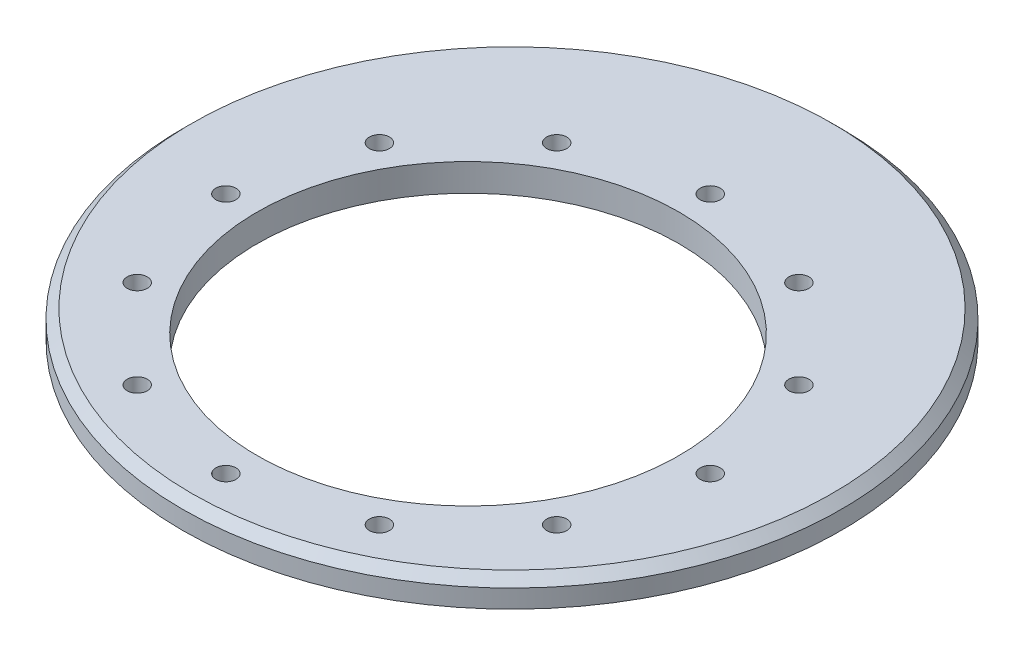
ISO-10303-21;
HEADER;
FILE_DESCRIPTION(('STEP AP214'),'2;1');
FILE_NAME('part.step','',(''),(''),'','','');
FILE_SCHEMA(('AUTOMOTIVE_DESIGN { 1 0 10303 214 1 1 1 1 }'));
ENDSEC;
DATA;
#1=APPLICATION_CONTEXT('core data for automotive mechanical design processes');
#2=APPLICATION_PROTOCOL_DEFINITION('international standard','automotive_design',2000,#1);
#3=PRODUCT_CONTEXT('',#1,'mechanical');
#4=PRODUCT('Part','Part','',(#3));
#5=PRODUCT_RELATED_PRODUCT_CATEGORY('part','',(#4));
#6=PRODUCT_DEFINITION_FORMATION('','',#4);
#7=PRODUCT_DEFINITION_CONTEXT('part definition',#1,'design');
#8=PRODUCT_DEFINITION('design','',#6,#7);
#9=PRODUCT_DEFINITION_SHAPE('','',#8);
#10=(LENGTH_UNIT() NAMED_UNIT(*) SI_UNIT(.MILLI.,.METRE.));
#11=(NAMED_UNIT(*) PLANE_ANGLE_UNIT() SI_UNIT($,.RADIAN.));
#12=(NAMED_UNIT(*) SI_UNIT($,.STERADIAN.) SOLID_ANGLE_UNIT());
#13=UNCERTAINTY_MEASURE_WITH_UNIT(LENGTH_MEASURE(1.E-05),#10,'distance_accuracy_value','');
#14=(GEOMETRIC_REPRESENTATION_CONTEXT(3) GLOBAL_UNCERTAINTY_ASSIGNED_CONTEXT((#13)) GLOBAL_UNIT_ASSIGNED_CONTEXT((#10,
#11,#12)) REPRESENTATION_CONTEXT('',''));
#15=CARTESIAN_POINT('',(0.,0.,0.));
#16=DIRECTION('',(0.,0.,1.));
#17=DIRECTION('',(1.,0.,0.));
#18=AXIS2_PLACEMENT_3D('',#15,#16,#17);
#19=CARTESIAN_POINT('',(0.,-9.525,0.));
#20=DIRECTION('',(0.,1.,0.));
#21=DIRECTION('',(0.,0.,1.));
#22=AXIS2_PLACEMENT_3D('',#19,#20,#21);
#23=CYLINDRICAL_SURFACE('',#22,114.3);
#24=CARTESIAN_POINT('',(0.,-3.17499999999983,0.));
#25=DIRECTION('',(0.,1.,0.));
#26=DIRECTION('',(0.,0.,1.));
#27=AXIS2_PLACEMENT_3D('',#24,#25,#26);
#28=CIRCLE('',#27,114.3);
#29=CARTESIAN_POINT('',(0.,-3.17499999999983,114.3));
#30=VERTEX_POINT('',#29);
#31=EDGE_CURVE('E10',#30,#30,#28,.F.);
#32=CARTESIAN_POINT('',(0.,-9.525,0.));
#33=DIRECTION('',(0.,1.,0.));
#34=DIRECTION('',(0.,0.,1.));
#35=AXIS2_PLACEMENT_3D('',#32,#33,#34);
#36=CIRCLE('',#35,114.3);
#37=CARTESIAN_POINT('',(0.,-9.525,114.3));
#38=VERTEX_POINT('',#37);
#39=EDGE_CURVE('E40',#38,#38,#36,.T.);
#40=CARTESIAN_POINT('',(0.,-3.17499999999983,114.3));
#41=CARTESIAN_POINT('',(0.,-3.24114583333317,114.3));
#42=CARTESIAN_POINT('',(0.,-3.3072916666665,114.3));
#43=CARTESIAN_POINT('',(0.,-3.43958333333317,114.3));
#44=CARTESIAN_POINT('',(0.,-3.50572916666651,114.3));
#45=CARTESIAN_POINT('',(0.,-3.63802083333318,114.3));
#46=CARTESIAN_POINT('',(0.,-3.70416666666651,114.3));
#47=CARTESIAN_POINT('',(0.,-3.83645833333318,114.3));
#48=CARTESIAN_POINT('',(0.,-3.90260416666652,114.3));
#49=CARTESIAN_POINT('',(0.,-4.03489583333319,114.3));
#50=CARTESIAN_POINT('',(0.,-4.10104166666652,114.3));
#51=CARTESIAN_POINT('',(0.,-4.23333333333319,114.3));
#52=CARTESIAN_POINT('',(0.,-4.29947916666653,114.3));
#53=CARTESIAN_POINT('',(0.,-4.4317708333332,114.3));
#54=CARTESIAN_POINT('',(0.,-4.49791666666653,114.3));
#55=CARTESIAN_POINT('',(0.,-4.6302083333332,114.3));
#56=CARTESIAN_POINT('',(0.,-4.69635416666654,114.3));
#57=CARTESIAN_POINT('',(0.,-4.82864583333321,114.3));
#58=CARTESIAN_POINT('',(0.,-4.89479166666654,114.3));
#59=CARTESIAN_POINT('',(0.,-5.02708333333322,114.3));
#60=CARTESIAN_POINT('',(0.,-5.09322916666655,114.3));
#61=CARTESIAN_POINT('',(0.,-5.22552083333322,114.3));
#62=CARTESIAN_POINT('',(0.,-5.29166666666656,114.3));
#63=CARTESIAN_POINT('',(0.,-5.42395833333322,114.3));
#64=CARTESIAN_POINT('',(0.,-5.49010416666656,114.3));
#65=CARTESIAN_POINT('',(0.,-5.62239583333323,114.3));
#66=CARTESIAN_POINT('',(0.,-5.68854166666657,114.3));
#67=CARTESIAN_POINT('',(0.,-5.82083333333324,114.3));
#68=CARTESIAN_POINT('',(0.,-5.88697916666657,114.3));
#69=CARTESIAN_POINT('',(0.,-6.01927083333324,114.3));
#70=CARTESIAN_POINT('',(0.,-6.08541666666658,114.3));
#71=CARTESIAN_POINT('',(0.,-6.21770833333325,114.3));
#72=CARTESIAN_POINT('',(0.,-6.28385416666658,114.3));
#73=CARTESIAN_POINT('',(0.,-6.41614583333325,114.3));
#74=CARTESIAN_POINT('',(0.,-6.48229166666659,114.3));
#75=CARTESIAN_POINT('',(0.,-6.61458333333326,114.3));
#76=CARTESIAN_POINT('',(0.,-6.68072916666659,114.3));
#77=CARTESIAN_POINT('',(0.,-6.81302083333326,114.3));
#78=CARTESIAN_POINT('',(0.,-6.8791666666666,114.3));
#79=CARTESIAN_POINT('',(0.,-7.01145833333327,114.3));
#80=CARTESIAN_POINT('',(0.,-7.0776041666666,114.3));
#81=CARTESIAN_POINT('',(0.,-7.20989583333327,114.3));
#82=CARTESIAN_POINT('',(0.,-7.27604166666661,114.3));
#83=CARTESIAN_POINT('',(0.,-7.40833333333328,114.3));
#84=CARTESIAN_POINT('',(0.,-7.47447916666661,114.3));
#85=CARTESIAN_POINT('',(0.,-7.60677083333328,114.3));
#86=CARTESIAN_POINT('',(0.,-7.67291666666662,114.3));
#87=CARTESIAN_POINT('',(0.,-7.80520833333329,114.3));
#88=CARTESIAN_POINT('',(0.,-7.87135416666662,114.3));
#89=CARTESIAN_POINT('',(0.,-8.00364583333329,114.3));
#90=CARTESIAN_POINT('',(0.,-8.06979166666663,114.3));
#91=CARTESIAN_POINT('',(0.,-8.2020833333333,114.3));
#92=CARTESIAN_POINT('',(0.,-8.26822916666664,114.3));
#93=CARTESIAN_POINT('',(0.,-8.4005208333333,114.3));
#94=CARTESIAN_POINT('',(0.,-8.46666666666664,114.3));
#95=CARTESIAN_POINT('',(0.,-8.59895833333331,114.3));
#96=CARTESIAN_POINT('',(0.,-8.66510416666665,114.3));
#97=CARTESIAN_POINT('',(0.,-8.79739583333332,114.3));
#98=CARTESIAN_POINT('',(0.,-8.86354166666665,114.3));
#99=CARTESIAN_POINT('',(0.,-8.99583333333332,114.3));
#100=CARTESIAN_POINT('',(0.,-9.06197916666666,114.3));
#101=CARTESIAN_POINT('',(0.,-9.19427083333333,114.3));
#102=CARTESIAN_POINT('',(0.,-9.26041666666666,114.3));
#103=CARTESIAN_POINT('',(0.,-9.39270833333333,114.3));
#104=CARTESIAN_POINT('',(0.,-9.45885416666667,114.3));
#105=CARTESIAN_POINT('',(0.,-9.525,114.3));
#106=B_SPLINE_CURVE_WITH_KNOTS('',3,(#40,#41,#42,#43,#44,#45,#46,#47,#48,#49,#50,#51,#52,#53,
#54,#55,#56,#57,#58,#59,#60,#61,#62,#63,#64,#65,#66,#67,#68,#69,#70,#71,#72,#73,#74,#75,#76,#77,
#78,#79,#80,#81,#82,#83,#84,#85,#86,#87,#88,#89,#90,#91,#92,#93,#94,#95,#96,#97,#98,#99,#100,
#101,#102,#103,#104,#105),.UNSPECIFIED.,.F.,.F.,(4,2,2,2,2,2,2,2,2,2,2,2,2,2,2,2,2,2,2,2,2,2,2,
2,2,2,2,2,2,2,2,2,4),(0.,0.198437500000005,0.396875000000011,0.595312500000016,
0.793750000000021,0.992187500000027,1.19062500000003,1.38906250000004,1.58750000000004,
1.78593750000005,1.98437500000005,2.18281250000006,2.38125000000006,2.57968750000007,
2.77812500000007,2.97656250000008,3.17500000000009,3.37343750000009,3.57187500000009,
3.7703125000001,3.96875000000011,4.16718750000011,4.36562500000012,4.56406250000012,
4.76250000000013,4.96093750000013,5.15937500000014,5.35781250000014,5.55625000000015,
5.75468750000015,5.95312500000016,6.15156250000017,6.35000000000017),.UNSPECIFIED.);
#107=EDGE_CURVE('BSEAM29',#30,#38,#106,.T.);
#108=ORIENTED_EDGE('',*,*,#31,.T.);
#109=ORIENTED_EDGE('',*,*,#39,.T.);
#110=ORIENTED_EDGE('',*,*,#107,.T.);
#111=ORIENTED_EDGE('',*,*,#107,.F.);
#112=EDGE_LOOP('',(#108,#110,#109,#111));
#113=FACE_BOUND('',#112,.T.);
#114=ADVANCED_FACE('F29',(#113),#23,.T.);
#115=CARTESIAN_POINT('',(0.,-9.525,0.));
#116=DIRECTION('',(0.,1.,0.));
#117=DIRECTION('',(0.,0.,1.));
#118=AXIS2_PLACEMENT_3D('',#115,#116,#117);
#119=PLANE('',#118);
#120=CARTESIAN_POINT('',(0.,-9.525,15.24));
#121=DIRECTION('',(0.,-1.,0.));
#122=DIRECTION('',(0.,0.,-1.));
#123=AXIS2_PLACEMENT_3D('',#120,#121,#122);
#124=CIRCLE('',#123,73.175);
#125=CARTESIAN_POINT('',(0.,-9.525,-57.935));
#126=VERTEX_POINT('',#125);
#127=EDGE_CURVE('E119',#126,#126,#124,.T.);
#128=ORIENTED_EDGE('',*,*,#127,.F.);
#129=EDGE_LOOP('',(#128));
#130=FACE_BOUND('',#129,.T.);
#131=CARTESIAN_POINT('',(41.9999999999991,-9.525,87.9861339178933));
#132=DIRECTION('',(0.,-1.,0.));
#133=DIRECTION('',(-0.499999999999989,0.,-0.866025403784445));
#134=AXIS2_PLACEMENT_3D('',#131,#132,#133);
#135=CIRCLE('',#134,3.49049999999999);
#136=CARTESIAN_POINT('',(40.2547499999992,-9.525,84.9632722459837));
#137=VERTEX_POINT('',#136);
#138=EDGE_CURVE('E113',#137,#137,#135,.T.);
#139=ORIENTED_EDGE('',*,*,#138,.F.);
#140=EDGE_LOOP('',(#139));
#141=FACE_BOUND('',#140,.T.);
#142=CARTESIAN_POINT('',(72.7461339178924,-9.525,57.2400000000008));
#143=DIRECTION('',(0.,-1.,0.));
#144=DIRECTION('',(-0.866025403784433,0.,-0.50000000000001));
#145=AXIS2_PLACEMENT_3D('',#142,#143,#144);
#146=CIRCLE('',#145,3.49049999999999);
#147=CARTESIAN_POINT('',(69.7232722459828,-9.525,55.4947500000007));
#148=VERTEX_POINT('',#147);
#149=EDGE_CURVE('E107',#148,#148,#146,.T.);
#150=ORIENTED_EDGE('',*,*,#149,.F.);
#151=EDGE_LOOP('',(#150));
#152=FACE_BOUND('',#151,.T.);
#153=CARTESIAN_POINT('',(84.,-9.525,15.2400000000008));
#154=DIRECTION('',(0.,-1.,0.));
#155=DIRECTION('',(-1.,0.,0.));
#156=AXIS2_PLACEMENT_3D('',#153,#154,#155);
#157=CIRCLE('',#156,3.49049999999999);
#158=CARTESIAN_POINT('',(80.5095,-9.525,15.2400000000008));
#159=VERTEX_POINT('',#158);
#160=EDGE_CURVE('E101',#159,#159,#157,.T.);
#161=ORIENTED_EDGE('',*,*,#160,.F.);
#162=EDGE_LOOP('',(#161));
#163=FACE_BOUND('',#162,.T.);
#164=CARTESIAN_POINT('',(72.7461339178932,-9.525,-26.7599999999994));
#165=DIRECTION('',(0.,-1.,0.));
#166=DIRECTION('',(-0.866025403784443,0.,0.499999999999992));
#167=AXIS2_PLACEMENT_3D('',#164,#165,#166);
#168=CIRCLE('',#167,3.49049999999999);
#169=CARTESIAN_POINT('',(69.7232722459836,-9.525,-25.0147499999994));
#170=VERTEX_POINT('',#169);
#171=EDGE_CURVE('E95',#170,#170,#168,.T.);
#172=ORIENTED_EDGE('',*,*,#171,.F.);
#173=EDGE_LOOP('',(#172));
#174=FACE_BOUND('',#173,.T.);
#175=CARTESIAN_POINT('',(42.0000000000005,-9.525,-57.5061339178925));
#176=DIRECTION('',(0.,-1.,0.));
#177=DIRECTION('',(-0.500000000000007,0.,0.866025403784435));
#178=AXIS2_PLACEMENT_3D('',#175,#176,#177);
#179=CIRCLE('',#178,3.49049999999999);
#180=CARTESIAN_POINT('',(40.2547500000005,-9.525,-54.483272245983));
#181=VERTEX_POINT('',#180);
#182=EDGE_CURVE('E89',#181,#181,#179,.T.);
#183=ORIENTED_EDGE('',*,*,#182,.F.);
#184=EDGE_LOOP('',(#183));
#185=FACE_BOUND('',#184,.T.);
#186=CARTESIAN_POINT('',(5.26986032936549E-13,-9.525,-68.76));
#187=DIRECTION('',(0.,-1.,0.));
#188=DIRECTION('',(0.,0.,1.));
#189=AXIS2_PLACEMENT_3D('',#186,#187,#188);
#190=CIRCLE('',#189,3.49049999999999);
#191=CARTESIAN_POINT('',(5.02611987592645E-13,-9.525,-65.2695));
#192=VERTEX_POINT('',#191);
#193=EDGE_CURVE('E83',#192,#192,#190,.T.);
#194=ORIENTED_EDGE('',*,*,#193,.F.);
#195=EDGE_LOOP('',(#194));
#196=FACE_BOUND('',#195,.T.);
#197=CARTESIAN_POINT('',(-41.9999999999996,-9.525,-57.506133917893));
#198=DIRECTION('',(0.,-1.,0.));
#199=DIRECTION('',(0.499999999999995,0.,0.866025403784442));
#200=AXIS2_PLACEMENT_3D('',#197,#198,#199);
#201=CIRCLE('',#200,3.49049999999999);
#202=CARTESIAN_POINT('',(-40.2547499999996,-9.525,-54.4832722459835));
#203=VERTEX_POINT('',#202);
#204=EDGE_CURVE('E77',#203,#203,#201,.T.);
#205=ORIENTED_EDGE('',*,*,#204,.F.);
#206=EDGE_LOOP('',(#205));
#207=FACE_BOUND('',#206,.T.);
#208=CARTESIAN_POINT('',(-72.7461339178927,-9.52500000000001,-26.7600000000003));
#209=DIRECTION('',(0.,-1.,0.));
#210=DIRECTION('',(0.866025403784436,0.,0.500000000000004));
#211=AXIS2_PLACEMENT_3D('',#208,#209,#210);
#212=CIRCLE('',#211,3.49049999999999);
#213=CARTESIAN_POINT('',(-69.7232722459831,-9.52500000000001,-25.0147500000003));
#214=VERTEX_POINT('',#213);
#215=EDGE_CURVE('E71',#214,#214,#212,.T.);
#216=ORIENTED_EDGE('',*,*,#215,.F.);
#217=EDGE_LOOP('',(#216));
#218=FACE_BOUND('',#217,.T.);
#219=CARTESIAN_POINT('',(-84.,-9.52500000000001,15.2399999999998));
#220=DIRECTION('',(0.,-1.,0.));
#221=DIRECTION('',(1.,0.,0.));
#222=AXIS2_PLACEMENT_3D('',#219,#220,#221);
#223=CIRCLE('',#222,3.49049999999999);
#224=CARTESIAN_POINT('',(-80.5095,-9.52500000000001,15.2399999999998));
#225=VERTEX_POINT('',#224);
#226=EDGE_CURVE('E65',#225,#225,#223,.T.);
#227=ORIENTED_EDGE('',*,*,#226,.F.);
#228=EDGE_LOOP('',(#227));
#229=FACE_BOUND('',#228,.T.);
#230=CARTESIAN_POINT('',(-72.7461339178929,-9.52500000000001,57.2399999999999));
#231=DIRECTION('',(0.,-1.,0.));
#232=DIRECTION('',(0.86602540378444,0.,-0.499999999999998));
#233=AXIS2_PLACEMENT_3D('',#230,#231,#232);
#234=CIRCLE('',#233,3.49049999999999);
#235=CARTESIAN_POINT('',(-69.7232722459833,-9.52500000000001,55.4947499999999));
#236=VERTEX_POINT('',#235);
#237=EDGE_CURVE('E59',#236,#236,#234,.T.);
#238=ORIENTED_EDGE('',*,*,#237,.F.);
#239=EDGE_LOOP('',(#238));
#240=FACE_BOUND('',#239,.T.);
#241=CARTESIAN_POINT('',(-42.,-9.525,87.9861339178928));
#242=DIRECTION('',(0.,-1.,0.));
#243=DIRECTION('',(0.500000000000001,0.,-0.866025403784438));
#244=AXIS2_PLACEMENT_3D('',#241,#242,#243);
#245=CIRCLE('',#244,3.49049999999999);
#246=CARTESIAN_POINT('',(-40.25475,-9.525,84.9632722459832));
#247=VERTEX_POINT('',#246);
#248=EDGE_CURVE('E53',#247,#247,#245,.T.);
#249=ORIENTED_EDGE('',*,*,#248,.F.);
#250=EDGE_LOOP('',(#249));
#251=FACE_BOUND('',#250,.T.);
#252=CARTESIAN_POINT('',(0.,-9.525,99.24));
#253=DIRECTION('',(0.,-1.,0.));
#254=DIRECTION('',(0.,0.,-1.));
#255=AXIS2_PLACEMENT_3D('',#252,#253,#254);
#256=CIRCLE('',#255,3.49049999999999);
#257=CARTESIAN_POINT('',(0.,-9.525,95.7495));
#258=VERTEX_POINT('',#257);
#259=EDGE_CURVE('E47',#258,#258,#256,.T.);
#260=ORIENTED_EDGE('',*,*,#259,.F.);
#261=EDGE_LOOP('',(#260));
#262=FACE_BOUND('',#261,.T.);
#263=ORIENTED_EDGE('',*,*,#39,.F.);
#264=EDGE_LOOP('',(#263));
#265=FACE_BOUND('',#264,.T.);
#266=ADVANCED_FACE('F135',(#130,#141,#152,#163,#174,#185,#196,#207,#218,#229,#240,#251,#262,
#265),#119,.F.);
#267=CARTESIAN_POINT('',(0.,0.,0.));
#268=DIRECTION('',(0.,1.,0.));
#269=DIRECTION('',(0.,0.,1.));
#270=AXIS2_PLACEMENT_3D('',#267,#268,#269);
#271=PLANE('',#270);
#272=CARTESIAN_POINT('',(0.,0.,15.24));
#273=DIRECTION('',(0.,-1.,0.));
#274=DIRECTION('',(0.,0.,-1.));
#275=AXIS2_PLACEMENT_3D('',#272,#273,#274);
#276=CIRCLE('',#275,73.175);
#277=CARTESIAN_POINT('',(0.,0.,-57.935));
#278=VERTEX_POINT('',#277);
#279=EDGE_CURVE('E116',#278,#278,#276,.T.);
#280=ORIENTED_EDGE('',*,*,#279,.T.);
#281=EDGE_LOOP('',(#280));
#282=FACE_BOUND('',#281,.T.);
#283=CARTESIAN_POINT('',(41.9999999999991,0.,87.9861339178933));
#284=DIRECTION('',(0.,-1.,0.));
#285=DIRECTION('',(-0.499999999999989,0.,-0.866025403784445));
#286=AXIS2_PLACEMENT_3D('',#283,#284,#285);
#287=CIRCLE('',#286,3.49049999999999);
#288=CARTESIAN_POINT('',(40.2547499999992,0.,84.9632722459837));
#289=VERTEX_POINT('',#288);
#290=EDGE_CURVE('E110',#289,#289,#287,.T.);
#291=ORIENTED_EDGE('',*,*,#290,.T.);
#292=EDGE_LOOP('',(#291));
#293=FACE_BOUND('',#292,.T.);
#294=CARTESIAN_POINT('',(72.7461339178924,0.,57.2400000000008));
#295=DIRECTION('',(0.,-1.,0.));
#296=DIRECTION('',(-0.866025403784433,0.,-0.50000000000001));
#297=AXIS2_PLACEMENT_3D('',#294,#295,#296);
#298=CIRCLE('',#297,3.49049999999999);
#299=CARTESIAN_POINT('',(69.7232722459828,0.,55.4947500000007));
#300=VERTEX_POINT('',#299);
#301=EDGE_CURVE('E104',#300,#300,#298,.T.);
#302=ORIENTED_EDGE('',*,*,#301,.T.);
#303=EDGE_LOOP('',(#302));
#304=FACE_BOUND('',#303,.T.);
#305=CARTESIAN_POINT('',(84.,0.,15.2400000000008));
#306=DIRECTION('',(0.,-1.,0.));
#307=DIRECTION('',(-1.,0.,0.));
#308=AXIS2_PLACEMENT_3D('',#305,#306,#307);
#309=CIRCLE('',#308,3.49049999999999);
#310=CARTESIAN_POINT('',(80.5095,0.,15.2400000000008));
#311=VERTEX_POINT('',#310);
#312=EDGE_CURVE('E98',#311,#311,#309,.T.);
#313=ORIENTED_EDGE('',*,*,#312,.T.);
#314=EDGE_LOOP('',(#313));
#315=FACE_BOUND('',#314,.T.);
#316=CARTESIAN_POINT('',(72.7461339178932,0.,-26.7599999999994));
#317=DIRECTION('',(0.,-1.,0.));
#318=DIRECTION('',(-0.866025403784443,0.,0.499999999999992));
#319=AXIS2_PLACEMENT_3D('',#316,#317,#318);
#320=CIRCLE('',#319,3.49049999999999);
#321=CARTESIAN_POINT('',(69.7232722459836,0.,-25.0147499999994));
#322=VERTEX_POINT('',#321);
#323=EDGE_CURVE('E92',#322,#322,#320,.T.);
#324=ORIENTED_EDGE('',*,*,#323,.T.);
#325=EDGE_LOOP('',(#324));
#326=FACE_BOUND('',#325,.T.);
#327=CARTESIAN_POINT('',(42.0000000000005,0.,-57.5061339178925));
#328=DIRECTION('',(0.,-1.,0.));
#329=DIRECTION('',(-0.500000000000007,0.,0.866025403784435));
#330=AXIS2_PLACEMENT_3D('',#327,#328,#329);
#331=CIRCLE('',#330,3.49049999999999);
#332=CARTESIAN_POINT('',(40.2547500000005,0.,-54.483272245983));
#333=VERTEX_POINT('',#332);
#334=EDGE_CURVE('E86',#333,#333,#331,.T.);
#335=ORIENTED_EDGE('',*,*,#334,.T.);
#336=EDGE_LOOP('',(#335));
#337=FACE_BOUND('',#336,.T.);
#338=CARTESIAN_POINT('',(5.25928545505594E-13,0.,-68.76));
#339=DIRECTION('',(0.,-1.,0.));
#340=DIRECTION('',(0.,0.,1.));
#341=AXIS2_PLACEMENT_3D('',#338,#339,#340);
#342=CIRCLE('',#341,3.49049999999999);
#343=CARTESIAN_POINT('',(5.01554500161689E-13,0.,-65.2695));
#344=VERTEX_POINT('',#343);
#345=EDGE_CURVE('E80',#344,#344,#342,.T.);
#346=ORIENTED_EDGE('',*,*,#345,.T.);
#347=EDGE_LOOP('',(#346));
#348=FACE_BOUND('',#347,.T.);
#349=CARTESIAN_POINT('',(-41.9999999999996,0.,-57.506133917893));
#350=DIRECTION('',(0.,-1.,0.));
#351=DIRECTION('',(0.499999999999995,0.,0.866025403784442));
#352=AXIS2_PLACEMENT_3D('',#349,#350,#351);
#353=CIRCLE('',#352,3.49049999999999);
#354=CARTESIAN_POINT('',(-40.2547499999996,0.,-54.4832722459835));
#355=VERTEX_POINT('',#354);
#356=EDGE_CURVE('E74',#355,#355,#353,.T.);
#357=ORIENTED_EDGE('',*,*,#356,.T.);
#358=EDGE_LOOP('',(#357));
#359=FACE_BOUND('',#358,.T.);
#360=CARTESIAN_POINT('',(-72.7461339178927,0.,-26.7600000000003));
#361=DIRECTION('',(0.,-1.,0.));
#362=DIRECTION('',(0.866025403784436,0.,0.500000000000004));
#363=AXIS2_PLACEMENT_3D('',#360,#361,#362);
#364=CIRCLE('',#363,3.49049999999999);
#365=CARTESIAN_POINT('',(-69.7232722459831,0.,-25.0147500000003));
#366=VERTEX_POINT('',#365);
#367=EDGE_CURVE('E68',#366,#366,#364,.T.);
#368=ORIENTED_EDGE('',*,*,#367,.T.);
#369=EDGE_LOOP('',(#368));
#370=FACE_BOUND('',#369,.T.);
#371=CARTESIAN_POINT('',(-84.,0.,15.2399999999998));
#372=DIRECTION('',(0.,-1.,0.));
#373=DIRECTION('',(1.,0.,0.));
#374=AXIS2_PLACEMENT_3D('',#371,#372,#373);
#375=CIRCLE('',#374,3.49049999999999);
#376=CARTESIAN_POINT('',(-80.5095,0.,15.2399999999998));
#377=VERTEX_POINT('',#376);
#378=EDGE_CURVE('E62',#377,#377,#375,.T.);
#379=ORIENTED_EDGE('',*,*,#378,.T.);
#380=EDGE_LOOP('',(#379));
#381=FACE_BOUND('',#380,.T.);
#382=CARTESIAN_POINT('',(-72.7461339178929,0.,57.2399999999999));
#383=DIRECTION('',(0.,-1.,0.));
#384=DIRECTION('',(0.86602540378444,0.,-0.499999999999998));
#385=AXIS2_PLACEMENT_3D('',#382,#383,#384);
#386=CIRCLE('',#385,3.49049999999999);
#387=CARTESIAN_POINT('',(-69.7232722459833,0.,55.4947499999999));
#388=VERTEX_POINT('',#387);
#389=EDGE_CURVE('E56',#388,#388,#386,.T.);
#390=ORIENTED_EDGE('',*,*,#389,.T.);
#391=EDGE_LOOP('',(#390));
#392=FACE_BOUND('',#391,.T.);
#393=CARTESIAN_POINT('',(-42.,0.,87.9861339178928));
#394=DIRECTION('',(0.,-1.,0.));
#395=DIRECTION('',(0.500000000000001,0.,-0.866025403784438));
#396=AXIS2_PLACEMENT_3D('',#393,#394,#395);
#397=CIRCLE('',#396,3.49049999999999);
#398=CARTESIAN_POINT('',(-40.25475,0.,84.9632722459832));
#399=VERTEX_POINT('',#398);
#400=EDGE_CURVE('E50',#399,#399,#397,.T.);
#401=ORIENTED_EDGE('',*,*,#400,.T.);
#402=EDGE_LOOP('',(#401));
#403=FACE_BOUND('',#402,.T.);
#404=CARTESIAN_POINT('',(0.,0.,99.24));
#405=DIRECTION('',(0.,-1.,0.));
#406=DIRECTION('',(0.,0.,-1.));
#407=AXIS2_PLACEMENT_3D('',#404,#405,#406);
#408=CIRCLE('',#407,3.49049999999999);
#409=CARTESIAN_POINT('',(0.,0.,95.7495));
#410=VERTEX_POINT('',#409);
#411=EDGE_CURVE('E44',#410,#410,#408,.T.);
#412=ORIENTED_EDGE('',*,*,#411,.T.);
#413=EDGE_LOOP('',(#412));
#414=FACE_BOUND('',#413,.T.);
#415=CARTESIAN_POINT('',(0.,0.,0.));
#416=DIRECTION('',(0.,1.,0.));
#417=DIRECTION('',(0.,0.,1.));
#418=AXIS2_PLACEMENT_3D('',#415,#416,#417);
#419=CIRCLE('',#418,111.125);
#420=CARTESIAN_POINT('',(0.,0.,111.125));
#421=VERTEX_POINT('',#420);
#422=EDGE_CURVE('E36',#421,#421,#419,.T.);
#423=ORIENTED_EDGE('',*,*,#422,.T.);
#424=EDGE_LOOP('',(#423));
#425=FACE_BOUND('',#424,.T.);
#426=ADVANCED_FACE('F125',(#282,#293,#304,#315,#326,#337,#348,#359,#370,#381,#392,#403,#414,
#425),#271,.T.);
#427=CARTESIAN_POINT('',(0.,0.,0.));
#428=DIRECTION('',(0.,-1.,0.));
#429=DIRECTION('',(0.,0.,-1.));
#430=AXIS2_PLACEMENT_3D('',#427,#428,#429);
#431=CONICAL_SURFACE('',#430,111.125,0.785398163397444);
#432=ORIENTED_EDGE('',*,*,#31,.F.);
#433=EDGE_LOOP('',(#432));
#434=FACE_BOUND('',#433,.T.);
#435=ORIENTED_EDGE('',*,*,#422,.F.);
#436=EDGE_LOOP('',(#435));
#437=FACE_BOUND('',#436,.T.);
#438=ADVANCED_FACE('F31',(#434,#437),#431,.T.);
#439=CARTESIAN_POINT('',(0.,0.,99.24));
#440=DIRECTION('',(0.,-1.,0.));
#441=DIRECTION('',(0.,0.,-1.));
#442=AXIS2_PLACEMENT_3D('',#439,#440,#441);
#443=CYLINDRICAL_SURFACE('',#442,3.49049999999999);
#444=CARTESIAN_POINT('',(0.,0.,95.7495));
#445=CARTESIAN_POINT('',(0.,-0.0992187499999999,95.7495));
#446=CARTESIAN_POINT('',(0.,-0.1984375,95.7495));
#447=CARTESIAN_POINT('',(0.,-0.396875,95.7495));
#448=CARTESIAN_POINT('',(0.,-0.49609375,95.7495));
#449=CARTESIAN_POINT('',(0.,-0.69453125,95.7495));
#450=CARTESIAN_POINT('',(0.,-0.79375,95.7495));
#451=CARTESIAN_POINT('',(0.,-0.9921875,95.7495));
#452=CARTESIAN_POINT('',(0.,-1.09140625,95.7495));
#453=CARTESIAN_POINT('',(0.,-1.28984375,95.7495));
#454=CARTESIAN_POINT('',(0.,-1.3890625,95.7495));
#455=CARTESIAN_POINT('',(0.,-1.5875,95.7495));
#456=CARTESIAN_POINT('',(0.,-1.68671875,95.7495));
#457=CARTESIAN_POINT('',(0.,-1.88515625,95.7495));
#458=CARTESIAN_POINT('',(0.,-1.984375,95.7495));
#459=CARTESIAN_POINT('',(0.,-2.1828125,95.7495));
#460=CARTESIAN_POINT('',(0.,-2.28203125,95.7495));
#461=CARTESIAN_POINT('',(0.,-2.48046875,95.7495));
#462=CARTESIAN_POINT('',(0.,-2.5796875,95.7495));
#463=CARTESIAN_POINT('',(0.,-2.778125,95.7495));
#464=CARTESIAN_POINT('',(0.,-2.87734375,95.7495));
#465=CARTESIAN_POINT('',(0.,-3.07578125,95.7495));
#466=CARTESIAN_POINT('',(0.,-3.175,95.7495));
#467=CARTESIAN_POINT('',(0.,-3.3734375,95.7495));
#468=CARTESIAN_POINT('',(0.,-3.47265625,95.7495));
#469=CARTESIAN_POINT('',(0.,-3.67109375,95.7495));
#470=CARTESIAN_POINT('',(0.,-3.7703125,95.7495));
#471=CARTESIAN_POINT('',(0.,-3.96875,95.7495));
#472=CARTESIAN_POINT('',(0.,-4.06796875,95.7495));
#473=CARTESIAN_POINT('',(0.,-4.26640625,95.7495));
#474=CARTESIAN_POINT('',(0.,-4.365625,95.7495));
#475=CARTESIAN_POINT('',(0.,-4.5640625,95.7495));
#476=CARTESIAN_POINT('',(0.,-4.66328125,95.7495));
#477=CARTESIAN_POINT('',(0.,-4.86171875,95.7495));
#478=CARTESIAN_POINT('',(0.,-4.9609375,95.7495));
#479=CARTESIAN_POINT('',(0.,-5.159375,95.7495));
#480=CARTESIAN_POINT('',(0.,-5.25859375,95.7495));
#481=CARTESIAN_POINT('',(0.,-5.45703125,95.7495));
#482=CARTESIAN_POINT('',(0.,-5.55625,95.7495));
#483=CARTESIAN_POINT('',(0.,-5.7546875,95.7495));
#484=CARTESIAN_POINT('',(0.,-5.85390625,95.7495));
#485=CARTESIAN_POINT('',(0.,-6.05234375,95.7495));
#486=CARTESIAN_POINT('',(0.,-6.1515625,95.7495));
#487=CARTESIAN_POINT('',(0.,-6.35,95.7495));
#488=CARTESIAN_POINT('',(0.,-6.44921875,95.7495));
#489=CARTESIAN_POINT('',(0.,-6.64765625,95.7495));
#490=CARTESIAN_POINT('',(0.,-6.746875,95.7495));
#491=CARTESIAN_POINT('',(0.,-6.9453125,95.7495));
#492=CARTESIAN_POINT('',(0.,-7.04453125,95.7495));
#493=CARTESIAN_POINT('',(0.,-7.24296875,95.7495));
#494=CARTESIAN_POINT('',(0.,-7.3421875,95.7495));
#495=CARTESIAN_POINT('',(0.,-7.540625,95.7495));
#496=CARTESIAN_POINT('',(0.,-7.63984375,95.7495));
#497=CARTESIAN_POINT('',(0.,-7.83828125,95.7495));
#498=CARTESIAN_POINT('',(0.,-7.9375,95.7495));
#499=CARTESIAN_POINT('',(0.,-8.1359375,95.7495));
#500=CARTESIAN_POINT('',(0.,-8.23515625,95.7495));
#501=CARTESIAN_POINT('',(0.,-8.43359375,95.7495));
#502=CARTESIAN_POINT('',(0.,-8.5328125,95.7495));
#503=CARTESIAN_POINT('',(0.,-8.73125,95.7495));
#504=CARTESIAN_POINT('',(0.,-8.83046875,95.7495));
#505=CARTESIAN_POINT('',(0.,-9.02890625,95.7495));
#506=CARTESIAN_POINT('',(0.,-9.128125,95.7495));
#507=CARTESIAN_POINT('',(0.,-9.3265625,95.7495));
#508=CARTESIAN_POINT('',(0.,-9.42578125,95.7495));
#509=CARTESIAN_POINT('',(0.,-9.525,95.7495));
#510=B_SPLINE_CURVE_WITH_KNOTS('',3,(#444,#445,#446,#447,#448,#449,#450,#451,#452,#453,#454,
#455,#456,#457,#458,#459,#460,#461,#462,#463,#464,#465,#466,#467,#468,#469,#470,#471,#472,#473,
#474,#475,#476,#477,#478,#479,#480,#481,#482,#483,#484,#485,#486,#487,#488,#489,#490,#491,#492,
#493,#494,#495,#496,#497,#498,#499,#500,#501,#502,#503,#504,#505,#506,#507,#508,#509),
.UNSPECIFIED.,.F.,.F.,(4,2,2,2,2,2,2,2,2,2,2,2,2,2,2,2,2,2,2,2,2,2,2,2,2,2,2,2,2,2,2,2,4),(0.,
0.29765625,0.5953125,0.89296875,1.190625,1.48828125,1.7859375,2.08359375,2.38125,2.67890625,
2.9765625,3.27421875,3.571875,3.86953125,4.1671875,4.46484375,4.7625,5.06015625,5.3578125,
5.65546875,5.953125,6.25078125,6.5484375,6.84609375,7.14375,7.44140625,7.7390625,8.03671875,
8.334375,8.63203125,8.9296875,9.22734375,9.525),.UNSPECIFIED.);
#511=EDGE_CURVE('BSEAM171',#410,#258,#510,.T.);
#512=ORIENTED_EDGE('',*,*,#411,.F.);
#513=ORIENTED_EDGE('',*,*,#259,.T.);
#514=ORIENTED_EDGE('',*,*,#511,.T.);
#515=ORIENTED_EDGE('',*,*,#511,.F.);
#516=EDGE_LOOP('',(#512,#514,#513,#515));
#517=FACE_BOUND('',#516,.T.);
#518=ADVANCED_FACE('F171',(#517),#443,.F.);
#519=CARTESIAN_POINT('',(-42.,0.,87.9861339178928));
#520=DIRECTION('',(0.,-1.,0.));
#521=DIRECTION('',(0.,0.,-1.));
#522=AXIS2_PLACEMENT_3D('',#519,#520,#521);
#523=CYLINDRICAL_SURFACE('',#522,3.49049999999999);
#524=ORIENTED_EDGE('',*,*,#400,.F.);
#525=EDGE_LOOP('',(#524));
#526=FACE_BOUND('',#525,.T.);
#527=ORIENTED_EDGE('',*,*,#248,.T.);
#528=EDGE_LOOP('',(#527));
#529=FACE_BOUND('',#528,.T.);
#530=ADVANCED_FACE('F174',(#526,#529),#523,.F.);
#531=CARTESIAN_POINT('',(-72.7461339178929,0.,57.2399999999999));
#532=DIRECTION('',(0.,-1.,0.));
#533=DIRECTION('',(0.,0.,-1.));
#534=AXIS2_PLACEMENT_3D('',#531,#532,#533);
#535=CYLINDRICAL_SURFACE('',#534,3.49049999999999);
#536=ORIENTED_EDGE('',*,*,#389,.F.);
#537=EDGE_LOOP('',(#536));
#538=FACE_BOUND('',#537,.T.);
#539=ORIENTED_EDGE('',*,*,#237,.T.);
#540=EDGE_LOOP('',(#539));
#541=FACE_BOUND('',#540,.T.);
#542=ADVANCED_FACE('F178',(#538,#541),#535,.F.);
#543=CARTESIAN_POINT('',(-84.,0.,15.2399999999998));
#544=DIRECTION('',(0.,-1.,0.));
#545=DIRECTION('',(1.,0.,0.));
#546=AXIS2_PLACEMENT_3D('',#543,#544,#545);
#547=CYLINDRICAL_SURFACE('',#546,3.49049999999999);
#548=ORIENTED_EDGE('',*,*,#378,.F.);
#549=EDGE_LOOP('',(#548));
#550=FACE_BOUND('',#549,.T.);
#551=ORIENTED_EDGE('',*,*,#226,.T.);
#552=EDGE_LOOP('',(#551));
#553=FACE_BOUND('',#552,.T.);
#554=ADVANCED_FACE('F182',(#550,#553),#547,.F.);
#555=CARTESIAN_POINT('',(-72.7461339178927,0.,-26.7600000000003));
#556=DIRECTION('',(0.,-1.,0.));
#557=DIRECTION('',(1.,0.,0.));
#558=AXIS2_PLACEMENT_3D('',#555,#556,#557);
#559=CYLINDRICAL_SURFACE('',#558,3.49049999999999);
#560=ORIENTED_EDGE('',*,*,#367,.F.);
#561=EDGE_LOOP('',(#560));
#562=FACE_BOUND('',#561,.T.);
#563=ORIENTED_EDGE('',*,*,#215,.T.);
#564=EDGE_LOOP('',(#563));
#565=FACE_BOUND('',#564,.T.);
#566=ADVANCED_FACE('F186',(#562,#565),#559,.F.);
#567=CARTESIAN_POINT('',(-41.9999999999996,0.,-57.506133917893));
#568=DIRECTION('',(0.,-1.,0.));
#569=DIRECTION('',(1.,0.,0.));
#570=AXIS2_PLACEMENT_3D('',#567,#568,#569);
#571=CYLINDRICAL_SURFACE('',#570,3.49049999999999);
#572=ORIENTED_EDGE('',*,*,#356,.F.);
#573=EDGE_LOOP('',(#572));
#574=FACE_BOUND('',#573,.T.);
#575=ORIENTED_EDGE('',*,*,#204,.T.);
#576=EDGE_LOOP('',(#575));
#577=FACE_BOUND('',#576,.T.);
#578=ADVANCED_FACE('F190',(#574,#577),#571,.F.);
#579=CARTESIAN_POINT('',(5.25928545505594E-13,0.,-68.76));
#580=DIRECTION('',(0.,-1.,0.));
#581=DIRECTION('',(1.,0.,0.));
#582=AXIS2_PLACEMENT_3D('',#579,#580,#581);
#583=CYLINDRICAL_SURFACE('',#582,3.49049999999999);
#584=ORIENTED_EDGE('',*,*,#345,.F.);
#585=EDGE_LOOP('',(#584));
#586=FACE_BOUND('',#585,.T.);
#587=ORIENTED_EDGE('',*,*,#193,.T.);
#588=EDGE_LOOP('',(#587));
#589=FACE_BOUND('',#588,.T.);
#590=ADVANCED_FACE('F194',(#586,#589),#583,.F.);
#591=CARTESIAN_POINT('',(42.0000000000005,0.,-57.5061339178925));
#592=DIRECTION('',(0.,-1.,0.));
#593=DIRECTION('',(1.,0.,0.));
#594=AXIS2_PLACEMENT_3D('',#591,#592,#593);
#595=CYLINDRICAL_SURFACE('',#594,3.49049999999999);
#596=ORIENTED_EDGE('',*,*,#334,.F.);
#597=EDGE_LOOP('',(#596));
#598=FACE_BOUND('',#597,.T.);
#599=ORIENTED_EDGE('',*,*,#182,.T.);
#600=EDGE_LOOP('',(#599));
#601=FACE_BOUND('',#600,.T.);
#602=ADVANCED_FACE('F198',(#598,#601),#595,.F.);
#603=CARTESIAN_POINT('',(72.7461339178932,0.,-26.7599999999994));
#604=DIRECTION('',(0.,-1.,0.));
#605=DIRECTION('',(1.,0.,0.));
#606=AXIS2_PLACEMENT_3D('',#603,#604,#605);
#607=CYLINDRICAL_SURFACE('',#606,3.49049999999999);
#608=ORIENTED_EDGE('',*,*,#323,.F.);
#609=EDGE_LOOP('',(#608));
#610=FACE_BOUND('',#609,.T.);
#611=ORIENTED_EDGE('',*,*,#171,.T.);
#612=EDGE_LOOP('',(#611));
#613=FACE_BOUND('',#612,.T.);
#614=ADVANCED_FACE('F202',(#610,#613),#607,.F.);
#615=CARTESIAN_POINT('',(84.,0.,15.2400000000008));
#616=DIRECTION('',(0.,-1.,0.));
#617=DIRECTION('',(0.,0.,-1.));
#618=AXIS2_PLACEMENT_3D('',#615,#616,#617);
#619=CYLINDRICAL_SURFACE('',#618,3.49049999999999);
#620=ORIENTED_EDGE('',*,*,#312,.F.);
#621=EDGE_LOOP('',(#620));
#622=FACE_BOUND('',#621,.T.);
#623=ORIENTED_EDGE('',*,*,#160,.T.);
#624=EDGE_LOOP('',(#623));
#625=FACE_BOUND('',#624,.T.);
#626=ADVANCED_FACE('F206',(#622,#625),#619,.F.);
#627=CARTESIAN_POINT('',(72.7461339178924,0.,57.2400000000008));
#628=DIRECTION('',(0.,-1.,0.));
#629=DIRECTION('',(0.,0.,-1.));
#630=AXIS2_PLACEMENT_3D('',#627,#628,#629);
#631=CYLINDRICAL_SURFACE('',#630,3.49049999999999);
#632=ORIENTED_EDGE('',*,*,#301,.F.);
#633=EDGE_LOOP('',(#632));
#634=FACE_BOUND('',#633,.T.);
#635=ORIENTED_EDGE('',*,*,#149,.T.);
#636=EDGE_LOOP('',(#635));
#637=FACE_BOUND('',#636,.T.);
#638=ADVANCED_FACE('F210',(#634,#637),#631,.F.);
#639=CARTESIAN_POINT('',(41.9999999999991,0.,87.9861339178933));
#640=DIRECTION('',(0.,-1.,0.));
#641=DIRECTION('',(0.,0.,-1.));
#642=AXIS2_PLACEMENT_3D('',#639,#640,#641);
#643=CYLINDRICAL_SURFACE('',#642,3.49049999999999);
#644=ORIENTED_EDGE('',*,*,#290,.F.);
#645=EDGE_LOOP('',(#644));
#646=FACE_BOUND('',#645,.T.);
#647=ORIENTED_EDGE('',*,*,#138,.T.);
#648=EDGE_LOOP('',(#647));
#649=FACE_BOUND('',#648,.T.);
#650=ADVANCED_FACE('F131',(#646,#649),#643,.F.);
#651=CARTESIAN_POINT('',(0.,0.,15.24));
#652=DIRECTION('',(0.,-1.,0.));
#653=DIRECTION('',(0.,0.,-1.));
#654=AXIS2_PLACEMENT_3D('',#651,#652,#653);
#655=CYLINDRICAL_SURFACE('',#654,73.175);
#656=ORIENTED_EDGE('',*,*,#279,.F.);
#657=EDGE_LOOP('',(#656));
#658=FACE_BOUND('',#657,.T.);
#659=ORIENTED_EDGE('',*,*,#127,.T.);
#660=EDGE_LOOP('',(#659));
#661=FACE_BOUND('',#660,.T.);
#662=ADVANCED_FACE('F128',(#658,#661),#655,.F.);
#663=CLOSED_SHELL('',(#114,#266,#426,#438,#518,#530,#542,#554,#566,#578,#590,#602,#614,#626,
#638,#650,#662));
#664=MANIFOLD_SOLID_BREP('B2',#663);
#665=ADVANCED_BREP_SHAPE_REPRESENTATION('',(#18,#664),#14);
#666=SHAPE_DEFINITION_REPRESENTATION(#9,#665);
ENDSEC;
END-ISO-10303-21;
